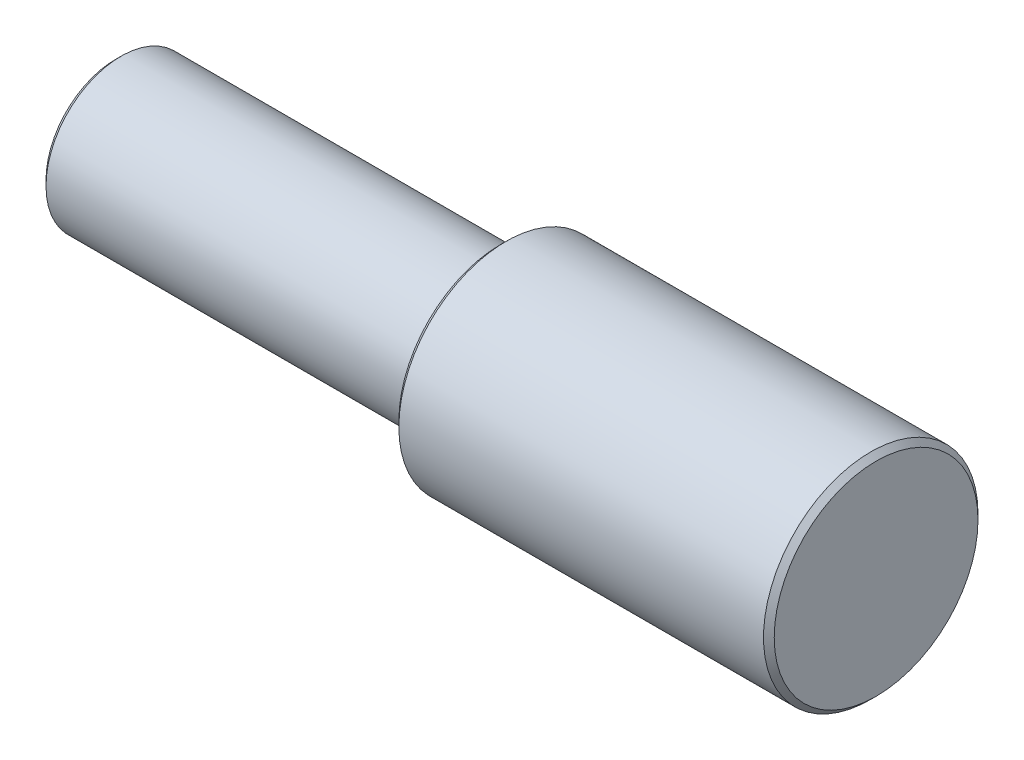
from build123d import *

# Parameters (mm, degrees)
SKETCH1_W                 = 35
SKETCH1_H                 = 10
SKETCH2_R                 = 7
BOSS_EXTRUDE1_DEPTH       = 35.9
M6X1_0_TAPPED_HOLE1_D     = 5
M6X1_0_TAPPED_HOLE1_DEPTH = 25
M6X1_0_TAPPED_HOLE1_TIP   = 1.502151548
CHAMFER1_SIZE             = 0.5
CUT_EXTRUDE2_DEPTH        = 10


with BuildPart() as part:
    # Sketch1 → Revolve1 (revolve)
    with BuildSketch(Plane.XY, mode=Mode.PRIVATE) as revolve1_sk:
        with Locations((-17.5, 5)):
            Rectangle(SKETCH1_W, SKETCH1_H)
    revolve(revolve1_sk.sketch.rotate(Axis((-35, 0, 0), (1, 0, 0)), 270), axis=Axis((-35, 0, 0), (1, 0, 0)))

    # Sketch2 → Boss-Extrude1 (add)
    with BuildSketch(Plane.ZY.offset(35)):
        Circle(SKETCH2_R)
    extrude(amount=BOSS_EXTRUDE1_DEPTH)

    # M6x1.0 Tapped Hole1
    with Locations(Plane.ZY.offset(70.9)):
        with Locations((0, 0)):
            Hole(M6X1_0_TAPPED_HOLE1_D / 2, depth=M6X1_0_TAPPED_HOLE1_DEPTH)
            with Locations((0, 0, -(M6X1_0_TAPPED_HOLE1_DEPTH + M6X1_0_TAPPED_HOLE1_TIP / 2))):  # 118° drill point
                Cone(0, M6X1_0_TAPPED_HOLE1_D / 2, M6X1_0_TAPPED_HOLE1_TIP, mode=Mode.SUBTRACT)

    # Chamfer1
    chamfer1_edges = [part.edges().sort_by_distance(p)[0] for p in [
        (-70.9, 0, -7),
        (-70.9, 0, 2.5),
        (0, 0, 10),
        (-35, 0, 10),
    ]]
    chamfer(chamfer1_edges, length=CHAMFER1_SIZE)

    # Sketch3 → Cut-Extrude2 (cut)
    with BuildSketch(Plane.XY.offset(-4)):
        with BuildLine():
            Line((-40.45, 2.5), (-65.45, 2.5))
            ThreePointArc((-65.45, 2.5), (-67.95, 0), (-65.45, -2.5))
            Line((-65.45, -2.5), (-40.45, -2.5))
            ThreePointArc((-40.45, -2.5), (-37.95, 0), (-40.45, 2.5))
        make_face()
    extrude(amount=-CUT_EXTRUDE2_DEPTH, mode=Mode.SUBTRACT)


solid = part.part
